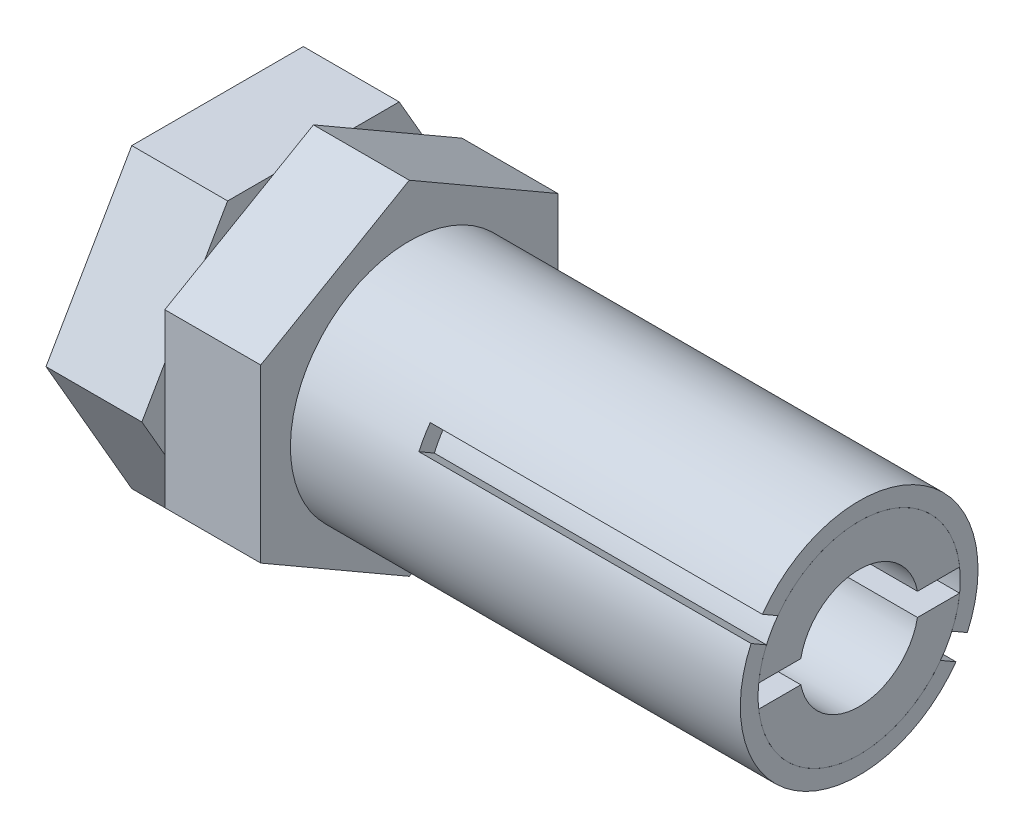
from build123d import *

# Parameters (mm, degrees)
SKETCH2_R               = 1.99898
EXTRUDE1_DEPTH          = 3.2258
SKETCH3_R               = 1.99898
EXTRUDE2_DEPTH          = 3.2258
SKETCH4_R               = 3.4036
SKETCH4_R_2             = 1.99898
EXTRUDE3_DEPTH          = 15.1384
SKETCH6_W               = 13.377121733
SKETCH6_H               = 0.762
CUT_EXTRUDE1_DEPTH      = 25.808331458
SKETCH7_R               = 3.99923
SKETCH7_R_2             = 3.4036
EXTRUDE4_DEPTH          = 15.1384
CUT_EXTRUDE2_REACH      = 27.23
CUT_EXTRUDE2_END_RADIUS = 3.4036
SKETCH8_W               = 12.326062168
SKETCH8_H               = 0.762
CUT_EXTRUDE3_START      = -10.770745
SKETCH9_W               = 11.671927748
SKETCH9_H               = 0.762
CUT_EXTRUDE3_DEPTH      = 11.54405


with BuildPart() as part:
    # Sketch2 → Extrude1 (new body)
    with BuildSketch(Plane(origin=(0, 0, 0), x_dir=(0, 0, -1), z_dir=(1, 0, 0))):
        Polygon((5.772024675, 0), (2.886012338, 4.99872), (-2.886012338, 4.99872), (-5.772024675, 0), (-2.886012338, -4.99872), (2.886012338, -4.99872), align=None)
        Circle(SKETCH2_R, mode=Mode.SUBTRACT)
    extrude(amount=EXTRUDE1_DEPTH)

    # Sketch3 → Extrude2 (add)
    with BuildSketch(Plane(origin=(3.2258, 0, 0), x_dir=(0, 0, -1), z_dir=(1, 0, 0))):
        Polygon((4.99872, 2.886012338), (0, 5.772024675), (-4.99872, 2.886012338), (-4.99872, -2.886012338), (0, -5.772024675), (4.99872, -2.886012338), align=None)
        Circle(SKETCH3_R, mode=Mode.SUBTRACT)
    extrude(amount=EXTRUDE2_DEPTH)

    # Sketch4 → Extrude3 (add)
    with BuildSketch(Plane(origin=(6.4516, 0, 0), x_dir=(0, 0, -1), z_dir=(1, 0, 0))):
        with Locations(Location((0, 0, 0), (0, 0, 180))):
            Circle(SKETCH4_R)
        Circle(SKETCH4_R_2, mode=Mode.SUBTRACT)
    extrude(amount=EXTRUDE3_DEPTH)

    # Sketch6 → Cut-Extrude1 (cut, through all)
    with BuildSketch(Plane.XY.offset(4.99872)):
        with Locations((17.102560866, 0)):
            Rectangle(SKETCH6_W, SKETCH6_H)
    extrude(amount=-CUT_EXTRUDE1_DEPTH, mode=Mode.SUBTRACT)


with BuildPart() as body_2:
    # Sketch7 → Extrude4 (new body)
    with BuildSketch(Plane(origin=(6.4516, 0, 0), x_dir=(0, 0, -1), z_dir=(1, 0, 0))):
        with Locations(Location((0, 0, 0), (0, 0, 180))):
            Circle(SKETCH7_R)
        with Locations(Location((0, 0, 0), (0, 0, 180))):
            Circle(SKETCH7_R_2, mode=Mode.SUBTRACT)
    extrude(amount=EXTRUDE4_DEPTH)

    # Cut-Extrude2: up to this cylinder (the profile starts outside it)
    cut_extrude2_end = Plane(origin=(16.577031, 0, 0), z_dir=(-1, 0, 0)) * Cylinder(CUT_EXTRUDE2_END_RADIUS, 62.2672, mode=Mode.PRIVATE)
    # Sketch8 → Cut-Extrude2 (cut, up to the surface)
    with BuildSketch(Plane(origin=(0, 2.49936, 4.329018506), x_dir=(1, 0, 0), z_dir=(0, 0.49999999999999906, 0.8660254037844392)), mode=Mode.PRIVATE) as cut_extrude2_sk1:
        with Locations((16.577031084, 0)):
            Rectangle(SKETCH8_W, SKETCH8_H)
    cut_extrude2_tool1 = extrude(cut_extrude2_sk1.sketch, amount=-CUT_EXTRUDE2_REACH, mode=Mode.PRIVATE) - cut_extrude2_end
    add(cut_extrude2_tool1.solids().sort_by_distance((16.577031, 2.49936, 4.329019))[0], mode=Mode.SUBTRACT)

    # Sketch9 → Cut-Extrude3 (cut)
    with BuildSketch(Plane(origin=(0, -2.49936, -4.329018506), x_dir=(-1, 0, 0), z_dir=(0, -0.4999999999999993, -0.866025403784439)).offset(CUT_EXTRUDE3_START)):
        with Locations((-16.249963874, 0)):
            Rectangle(SKETCH9_W, SKETCH9_H)
    extrude(amount=CUT_EXTRUDE3_DEPTH, mode=Mode.SUBTRACT)


solid = Compound([part.part, body_2.part])
